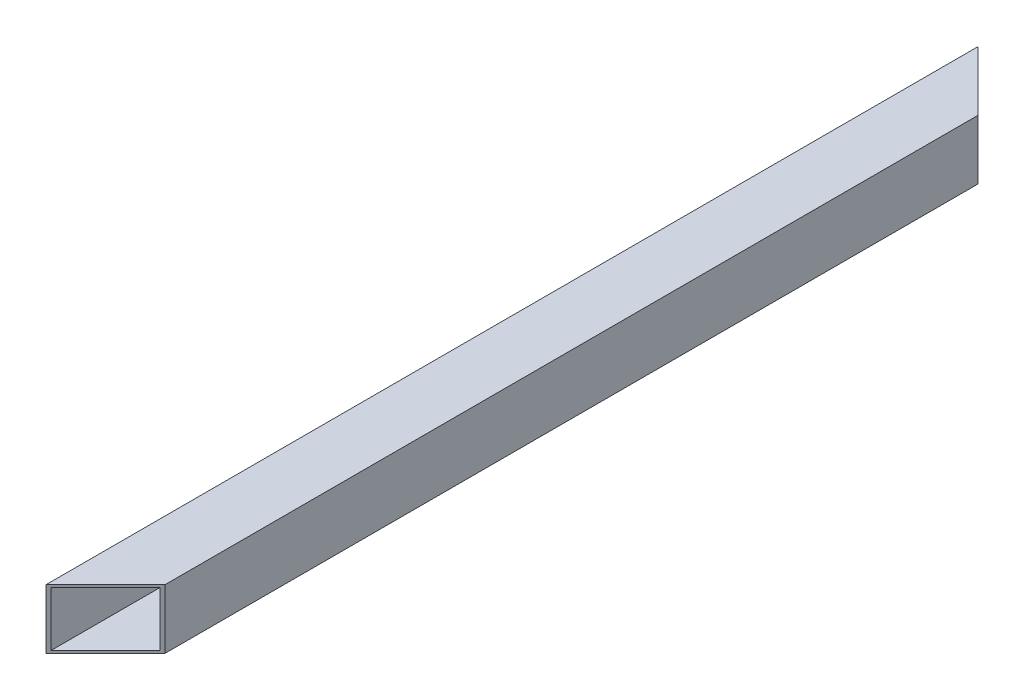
ISO-10303-21;
HEADER;
FILE_DESCRIPTION(('STEP AP214'),'2;1');
FILE_NAME('part.step','',(''),(''),'','','');
FILE_SCHEMA(('AUTOMOTIVE_DESIGN { 1 0 10303 214 1 1 1 1 }'));
ENDSEC;
DATA;
#1=APPLICATION_CONTEXT('core data for automotive mechanical design processes');
#2=APPLICATION_PROTOCOL_DEFINITION('international standard','automotive_design',2000,#1);
#3=PRODUCT_CONTEXT('',#1,'mechanical');
#4=PRODUCT('Part','Part','',(#3));
#5=PRODUCT_RELATED_PRODUCT_CATEGORY('part','',(#4));
#6=PRODUCT_DEFINITION_FORMATION('','',#4);
#7=PRODUCT_DEFINITION_CONTEXT('part definition',#1,'design');
#8=PRODUCT_DEFINITION('design','',#6,#7);
#9=PRODUCT_DEFINITION_SHAPE('','',#8);
#10=(LENGTH_UNIT() NAMED_UNIT(*) SI_UNIT(.MILLI.,.METRE.));
#11=(NAMED_UNIT(*) PLANE_ANGLE_UNIT() SI_UNIT($,.RADIAN.));
#12=(NAMED_UNIT(*) SI_UNIT($,.STERADIAN.) SOLID_ANGLE_UNIT());
#13=UNCERTAINTY_MEASURE_WITH_UNIT(LENGTH_MEASURE(1.E-05),#10,'distance_accuracy_value','');
#14=(GEOMETRIC_REPRESENTATION_CONTEXT(3) GLOBAL_UNCERTAINTY_ASSIGNED_CONTEXT((#13)) GLOBAL_UNIT_ASSIGNED_CONTEXT((#10,
#11,#12)) REPRESENTATION_CONTEXT('',''));
#15=CARTESIAN_POINT('',(0.,0.,0.));
#16=DIRECTION('',(0.,0.,1.));
#17=DIRECTION('',(1.,0.,0.));
#18=AXIS2_PLACEMENT_3D('',#15,#16,#17);
#19=CARTESIAN_POINT('',(-69.,69.,-75.));
#20=DIRECTION('',(1.,0.,0.));
#21=DIRECTION('',(0.,1.,0.));
#22=AXIS2_PLACEMENT_3D('',#19,#20,#21);
#23=PLANE('',#22);
#24=DIRECTION('',(0.,-1.,0.));
#25=VECTOR('',#24,1.);
#26=CARTESIAN_POINT('',(-69.,34.5,-69.));
#27=LINE('',#26,#25);
#28=CARTESIAN_POINT('',(-69.,69.,-69.));
#29=VERTEX_POINT('',#28);
#30=CARTESIAN_POINT('',(-69.,-69.,-69.));
#31=VERTEX_POINT('',#30);
#32=EDGE_CURVE('E165',#29,#31,#27,.T.);
#33=ORIENTED_EDGE('',*,*,#32,.F.);
#34=DIRECTION('',(0.,0.,1.));
#35=VECTOR('',#34,1.);
#36=CARTESIAN_POINT('',(-69.,69.,-75.));
#37=LINE('',#36,#35);
#38=CARTESIAN_POINT('',(-69.,69.,2269.));
#39=VERTEX_POINT('',#38);
#40=EDGE_CURVE('E10',#29,#39,#37,.T.);
#41=ORIENTED_EDGE('',*,*,#40,.T.);
#42=DIRECTION('',(0.,1.,0.));
#43=VECTOR('',#42,1.);
#44=CARTESIAN_POINT('',(-69.,34.5,2269.));
#45=LINE('',#44,#43);
#46=CARTESIAN_POINT('',(-69.,-69.,2269.));
#47=VERTEX_POINT('',#46);
#48=EDGE_CURVE('E117',#47,#39,#45,.T.);
#49=ORIENTED_EDGE('',*,*,#48,.F.);
#50=DIRECTION('',(0.,0.,1.));
#51=VECTOR('',#50,1.);
#52=CARTESIAN_POINT('',(-69.,-69.,-75.));
#53=LINE('',#52,#51);
#54=EDGE_CURVE('E105',#31,#47,#53,.T.);
#55=ORIENTED_EDGE('',*,*,#54,.F.);
#56=EDGE_LOOP('',(#33,#41,#49,#55));
#57=FACE_BOUND('',#56,.T.);
#58=ADVANCED_FACE('F16',(#57),#23,.T.);
#59=CARTESIAN_POINT('',(69.,69.,-75.));
#60=DIRECTION('',(0.,-1.,0.));
#61=DIRECTION('',(0.,0.,-1.));
#62=AXIS2_PLACEMENT_3D('',#59,#60,#61);
#63=PLANE('',#62);
#64=DIRECTION('',(-0.707106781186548,0.,-0.707106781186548));
#65=VECTOR('',#64,1.);
#66=CARTESIAN_POINT('',(-1.5,69.,-1.5));
#67=LINE('',#66,#65);
#68=CARTESIAN_POINT('',(69.,69.,69.));
#69=VERTEX_POINT('',#68);
#70=EDGE_CURVE('E161',#69,#29,#67,.T.);
#71=ORIENTED_EDGE('',*,*,#70,.F.);
#72=DIRECTION('',(0.,0.,1.));
#73=VECTOR('',#72,1.);
#74=CARTESIAN_POINT('',(69.,69.,-75.));
#75=LINE('',#74,#73);
#76=CARTESIAN_POINT('',(69.,69.,2131.));
#77=VERTEX_POINT('',#76);
#78=EDGE_CURVE('E19',#69,#77,#75,.T.);
#79=ORIENTED_EDGE('',*,*,#78,.T.);
#80=DIRECTION('',(0.707106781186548,0.,-0.707106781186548));
#81=VECTOR('',#80,1.);
#82=CARTESIAN_POINT('',(1136.,69.,1064.));
#83=LINE('',#82,#81);
#84=EDGE_CURVE('E135',#39,#77,#83,.T.);
#85=ORIENTED_EDGE('',*,*,#84,.F.);
#86=ORIENTED_EDGE('',*,*,#40,.F.);
#87=EDGE_LOOP('',(#71,#79,#85,#86));
#88=FACE_BOUND('',#87,.T.);
#89=ADVANCED_FACE('F195',(#88),#63,.T.);
#90=CARTESIAN_POINT('',(69.,-69.,-75.));
#91=DIRECTION('',(-1.,0.,0.));
#92=DIRECTION('',(0.,0.,1.));
#93=AXIS2_PLACEMENT_3D('',#90,#91,#92);
#94=PLANE('',#93);
#95=DIRECTION('',(0.,1.,0.));
#96=VECTOR('',#95,1.);
#97=CARTESIAN_POINT('',(69.,-34.5,69.));
#98=LINE('',#97,#96);
#99=CARTESIAN_POINT('',(69.,-69.,69.));
#100=VERTEX_POINT('',#99);
#101=EDGE_CURVE('E160',#100,#69,#98,.T.);
#102=ORIENTED_EDGE('',*,*,#101,.F.);
#103=DIRECTION('',(0.,0.,1.));
#104=VECTOR('',#103,1.);
#105=CARTESIAN_POINT('',(69.,-69.,-75.));
#106=LINE('',#105,#104);
#107=CARTESIAN_POINT('',(69.,-69.,2131.));
#108=VERTEX_POINT('',#107);
#109=EDGE_CURVE('E39',#100,#108,#106,.T.);
#110=ORIENTED_EDGE('',*,*,#109,.T.);
#111=DIRECTION('',(0.,-1.,0.));
#112=VECTOR('',#111,1.);
#113=CARTESIAN_POINT('',(69.,-34.5,2131.));
#114=LINE('',#113,#112);
#115=EDGE_CURVE('E139',#77,#108,#114,.T.);
#116=ORIENTED_EDGE('',*,*,#115,.F.);
#117=ORIENTED_EDGE('',*,*,#78,.F.);
#118=EDGE_LOOP('',(#102,#110,#116,#117));
#119=FACE_BOUND('',#118,.T.);
#120=ADVANCED_FACE('F204',(#119),#94,.T.);
#121=CARTESIAN_POINT('',(-69.,-69.,-75.));
#122=DIRECTION('',(0.,1.,0.));
#123=DIRECTION('',(1.,0.,0.));
#124=AXIS2_PLACEMENT_3D('',#121,#122,#123);
#125=PLANE('',#124);
#126=DIRECTION('',(0.707106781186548,0.,0.707106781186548));
#127=VECTOR('',#126,1.);
#128=CARTESIAN_POINT('',(-36.,-69.,-36.));
#129=LINE('',#128,#127);
#130=EDGE_CURVE('E168',#31,#100,#129,.T.);
#131=ORIENTED_EDGE('',*,*,#130,.F.);
#132=ORIENTED_EDGE('',*,*,#54,.T.);
#133=DIRECTION('',(-0.707106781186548,0.,0.707106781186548));
#134=VECTOR('',#133,1.);
#135=CARTESIAN_POINT('',(1101.5,-69.,1098.5));
#136=LINE('',#135,#134);
#137=EDGE_CURVE('E106',#108,#47,#136,.T.);
#138=ORIENTED_EDGE('',*,*,#137,.F.);
#139=ORIENTED_EDGE('',*,*,#109,.F.);
#140=EDGE_LOOP('',(#131,#132,#138,#139));
#141=FACE_BOUND('',#140,.T.);
#142=ADVANCED_FACE('F212',(#141),#125,.T.);
#143=CARTESIAN_POINT('',(75.,75.,-75.));
#144=DIRECTION('',(0.,-1.,0.));
#145=DIRECTION('',(0.,0.,-1.));
#146=AXIS2_PLACEMENT_3D('',#143,#144,#145);
#147=PLANE('',#146);
#148=DIRECTION('',(0.,0.,1.));
#149=VECTOR('',#148,1.);
#150=CARTESIAN_POINT('',(-75.,75.,-75.));
#151=LINE('',#150,#149);
#152=CARTESIAN_POINT('',(-75.,75.,-75.));
#153=VERTEX_POINT('',#152);
#154=CARTESIAN_POINT('',(-75.,75.,2275.));
#155=VERTEX_POINT('',#154);
#156=EDGE_CURVE('E93',#153,#155,#151,.T.);
#157=ORIENTED_EDGE('',*,*,#156,.T.);
#158=DIRECTION('',(0.707106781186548,0.,-0.707106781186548));
#159=VECTOR('',#158,1.);
#160=CARTESIAN_POINT('',(1137.5,75.,1062.5));
#161=LINE('',#160,#159);
#162=CARTESIAN_POINT('',(75.,75.,2125.));
#163=VERTEX_POINT('',#162);
#164=EDGE_CURVE('E97',#155,#163,#161,.T.);
#165=ORIENTED_EDGE('',*,*,#164,.T.);
#166=DIRECTION('',(0.,0.,1.));
#167=VECTOR('',#166,1.);
#168=CARTESIAN_POINT('',(75.,75.,-75.));
#169=LINE('',#168,#167);
#170=CARTESIAN_POINT('',(75.,75.,75.));
#171=VERTEX_POINT('',#170);
#172=EDGE_CURVE('E128',#171,#163,#169,.T.);
#173=ORIENTED_EDGE('',*,*,#172,.F.);
#174=DIRECTION('',(-0.707106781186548,0.,-0.707106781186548));
#175=VECTOR('',#174,1.);
#176=CARTESIAN_POINT('',(0.,75.,0.));
#177=LINE('',#176,#175);
#178=EDGE_CURVE('E100',#171,#153,#177,.T.);
#179=ORIENTED_EDGE('',*,*,#178,.T.);
#180=EDGE_LOOP('',(#157,#165,#173,#179));
#181=FACE_BOUND('',#180,.T.);
#182=ADVANCED_FACE('F95',(#181),#147,.F.);
#183=CARTESIAN_POINT('',(-75.,75.,-75.));
#184=DIRECTION('',(1.,0.,0.));
#185=DIRECTION('',(0.,1.,0.));
#186=AXIS2_PLACEMENT_3D('',#183,#184,#185);
#187=PLANE('',#186);
#188=DIRECTION('',(0.,-1.,0.));
#189=VECTOR('',#188,1.);
#190=CARTESIAN_POINT('',(-75.,75.,-75.));
#191=LINE('',#190,#189);
#192=CARTESIAN_POINT('',(-75.,-75.,-75.));
#193=VERTEX_POINT('',#192);
#194=EDGE_CURVE('E155',#153,#193,#191,.T.);
#195=ORIENTED_EDGE('',*,*,#194,.T.);
#196=DIRECTION('',(0.,0.,1.));
#197=VECTOR('',#196,1.);
#198=CARTESIAN_POINT('',(-75.,-75.,-75.));
#199=LINE('',#198,#197);
#200=CARTESIAN_POINT('',(-75.,-75.,2275.));
#201=VERTEX_POINT('',#200);
#202=EDGE_CURVE('E112',#193,#201,#199,.T.);
#203=ORIENTED_EDGE('',*,*,#202,.T.);
#204=DIRECTION('',(0.,-1.,0.));
#205=VECTOR('',#204,1.);
#206=CARTESIAN_POINT('',(-75.,75.,2275.));
#207=LINE('',#206,#205);
#208=EDGE_CURVE('E109',#155,#201,#207,.T.);
#209=ORIENTED_EDGE('',*,*,#208,.F.);
#210=ORIENTED_EDGE('',*,*,#156,.F.);
#211=EDGE_LOOP('',(#195,#203,#209,#210));
#212=FACE_BOUND('',#211,.T.);
#213=ADVANCED_FACE('F110',(#212),#187,.F.);
#214=CARTESIAN_POINT('',(1100.,0.,1100.));
#215=DIRECTION('',(-0.707106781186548,0.,-0.707106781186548));
#216=DIRECTION('',(-0.707106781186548,0.,0.707106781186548));
#217=AXIS2_PLACEMENT_3D('',#214,#215,#216);
#218=PLANE('',#217);
#219=ORIENTED_EDGE('',*,*,#48,.T.);
#220=ORIENTED_EDGE('',*,*,#84,.T.);
#221=ORIENTED_EDGE('',*,*,#115,.T.);
#222=ORIENTED_EDGE('',*,*,#137,.T.);
#223=EDGE_LOOP('',(#219,#220,#221,#222));
#224=FACE_BOUND('',#223,.T.);
#225=DIRECTION('',(-0.707106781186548,0.,0.707106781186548));
#226=VECTOR('',#225,1.);
#227=CARTESIAN_POINT('',(1100.,-75.,1100.));
#228=LINE('',#227,#226);
#229=CARTESIAN_POINT('',(75.,-75.,2125.));
#230=VERTEX_POINT('',#229);
#231=EDGE_CURVE('E285',#230,#201,#228,.T.);
#232=ORIENTED_EDGE('',*,*,#231,.F.);
#233=DIRECTION('',(0.,-1.,0.));
#234=VECTOR('',#233,1.);
#235=CARTESIAN_POINT('',(75.,-37.5,2125.));
#236=LINE('',#235,#234);
#237=EDGE_CURVE('E120',#163,#230,#236,.T.);
#238=ORIENTED_EDGE('',*,*,#237,.F.);
#239=ORIENTED_EDGE('',*,*,#164,.F.);
#240=ORIENTED_EDGE('',*,*,#208,.T.);
#241=EDGE_LOOP('',(#232,#238,#239,#240));
#242=FACE_BOUND('',#241,.T.);
#243=ADVANCED_FACE('F119',(#224,#242),#218,.F.);
#244=CARTESIAN_POINT('',(75.,-75.,-75.));
#245=DIRECTION('',(-1.,0.,0.));
#246=DIRECTION('',(0.,0.,1.));
#247=AXIS2_PLACEMENT_3D('',#244,#245,#246);
#248=PLANE('',#247);
#249=ORIENTED_EDGE('',*,*,#172,.T.);
#250=ORIENTED_EDGE('',*,*,#237,.T.);
#251=DIRECTION('',(0.,0.,1.));
#252=VECTOR('',#251,1.);
#253=CARTESIAN_POINT('',(75.,-75.,-75.));
#254=LINE('',#253,#252);
#255=CARTESIAN_POINT('',(75.,-75.,75.));
#256=VERTEX_POINT('',#255);
#257=EDGE_CURVE('E284',#256,#230,#254,.T.);
#258=ORIENTED_EDGE('',*,*,#257,.F.);
#259=DIRECTION('',(0.,1.,0.));
#260=VECTOR('',#259,1.);
#261=CARTESIAN_POINT('',(75.,-37.5,75.));
#262=LINE('',#261,#260);
#263=EDGE_CURVE('E157',#256,#171,#262,.T.);
#264=ORIENTED_EDGE('',*,*,#263,.T.);
#265=EDGE_LOOP('',(#249,#250,#258,#264));
#266=FACE_BOUND('',#265,.T.);
#267=ADVANCED_FACE('F177',(#266),#248,.F.);
#268=CARTESIAN_POINT('',(0.,0.,0.));
#269=DIRECTION('',(-0.707106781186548,0.,0.707106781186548));
#270=DIRECTION('',(0.,1.,0.));
#271=AXIS2_PLACEMENT_3D('',#268,#269,#270);
#272=PLANE('',#271);
#273=ORIENTED_EDGE('',*,*,#101,.T.);
#274=ORIENTED_EDGE('',*,*,#70,.T.);
#275=ORIENTED_EDGE('',*,*,#32,.T.);
#276=ORIENTED_EDGE('',*,*,#130,.T.);
#277=EDGE_LOOP('',(#273,#274,#275,#276));
#278=FACE_BOUND('',#277,.T.);
#279=ORIENTED_EDGE('',*,*,#263,.F.);
#280=DIRECTION('',(0.707106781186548,0.,0.707106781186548));
#281=VECTOR('',#280,1.);
#282=CARTESIAN_POINT('',(-37.5,-75.,-37.5));
#283=LINE('',#282,#281);
#284=EDGE_CURVE('E184',#193,#256,#283,.T.);
#285=ORIENTED_EDGE('',*,*,#284,.F.);
#286=ORIENTED_EDGE('',*,*,#194,.F.);
#287=ORIENTED_EDGE('',*,*,#178,.F.);
#288=EDGE_LOOP('',(#279,#285,#286,#287));
#289=FACE_BOUND('',#288,.T.);
#290=ADVANCED_FACE('F181',(#278,#289),#272,.F.);
#291=CARTESIAN_POINT('',(-75.,-75.,-75.));
#292=DIRECTION('',(0.,1.,0.));
#293=DIRECTION('',(1.,0.,0.));
#294=AXIS2_PLACEMENT_3D('',#291,#292,#293);
#295=PLANE('',#294);
#296=ORIENTED_EDGE('',*,*,#257,.T.);
#297=ORIENTED_EDGE('',*,*,#231,.T.);
#298=ORIENTED_EDGE('',*,*,#202,.F.);
#299=ORIENTED_EDGE('',*,*,#284,.T.);
#300=EDGE_LOOP('',(#296,#297,#298,#299));
#301=FACE_BOUND('',#300,.T.);
#302=ADVANCED_FACE('F256',(#301),#295,.F.);
#303=CLOSED_SHELL('',(#58,#89,#120,#142,#182,#213,#243,#267,#290,#302));
#304=MANIFOLD_SOLID_BREP('B1',#303);
#305=ADVANCED_BREP_SHAPE_REPRESENTATION('',(#18,#304),#14);
#306=SHAPE_DEFINITION_REPRESENTATION(#9,#305);
ENDSEC;
END-ISO-10303-21;
